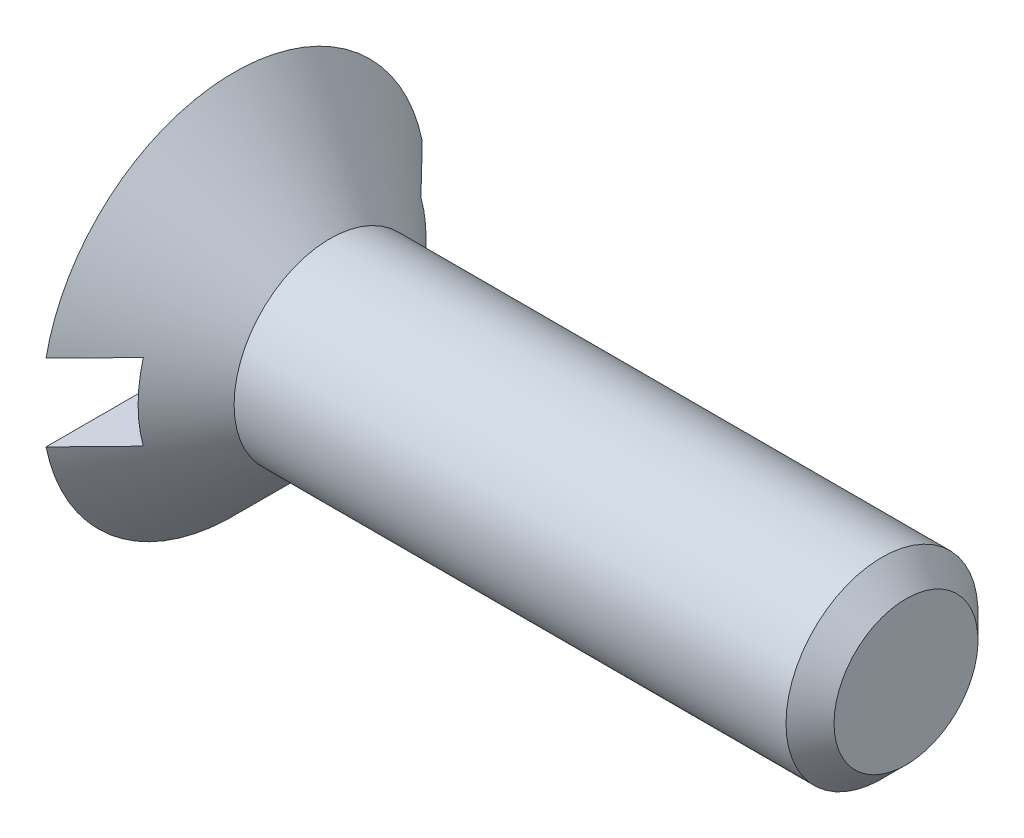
ISO-10303-21;
HEADER;
FILE_DESCRIPTION(('STEP AP214'),'2;1');
FILE_NAME('part.step','',(''),(''),'','','');
FILE_SCHEMA(('AUTOMOTIVE_DESIGN { 1 0 10303 214 1 1 1 1 }'));
ENDSEC;
DATA;
#1=APPLICATION_CONTEXT('core data for automotive mechanical design processes');
#2=APPLICATION_PROTOCOL_DEFINITION('international standard','automotive_design',2000,#1);
#3=PRODUCT_CONTEXT('',#1,'mechanical');
#4=PRODUCT('Part','Part','',(#3));
#5=PRODUCT_RELATED_PRODUCT_CATEGORY('part','',(#4));
#6=PRODUCT_DEFINITION_FORMATION('','',#4);
#7=PRODUCT_DEFINITION_CONTEXT('part definition',#1,'design');
#8=PRODUCT_DEFINITION('design','',#6,#7);
#9=PRODUCT_DEFINITION_SHAPE('','',#8);
#10=(LENGTH_UNIT() NAMED_UNIT(*) SI_UNIT(.MILLI.,.METRE.));
#11=(NAMED_UNIT(*) PLANE_ANGLE_UNIT() SI_UNIT($,.RADIAN.));
#12=(NAMED_UNIT(*) SI_UNIT($,.STERADIAN.) SOLID_ANGLE_UNIT());
#13=UNCERTAINTY_MEASURE_WITH_UNIT(LENGTH_MEASURE(1.E-05),#10,'distance_accuracy_value','');
#14=(GEOMETRIC_REPRESENTATION_CONTEXT(3) GLOBAL_UNCERTAINTY_ASSIGNED_CONTEXT((#13)) GLOBAL_UNIT_ASSIGNED_CONTEXT((#10,
#11,#12)) REPRESENTATION_CONTEXT('',''));
#15=CARTESIAN_POINT('',(0.,0.,0.));
#16=DIRECTION('',(0.,0.,1.));
#17=DIRECTION('',(1.,0.,0.));
#18=AXIS2_PLACEMENT_3D('',#15,#16,#17);
#19=CARTESIAN_POINT('',(0.,0.,0.));
#20=DIRECTION('',(1.,0.,0.));
#21=DIRECTION('',(0.,0.,-1.));
#22=AXIS2_PLACEMENT_3D('',#19,#20,#21);
#23=PLANE('',#22);
#24=CARTESIAN_POINT('',(0.,0.,0.));
#25=DIRECTION('',(-1.,0.,0.));
#26=DIRECTION('',(0.,0.,1.));
#27=AXIS2_PLACEMENT_3D('',#24,#25,#26);
#28=CIRCLE('',#27,2.);
#29=CARTESIAN_POINT('',(0.,0.399999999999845,1.95959179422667));
#30=VERTEX_POINT('',#29);
#31=CARTESIAN_POINT('',(0.,0.399999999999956,-1.95959179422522));
#32=VERTEX_POINT('',#31);
#33=EDGE_CURVE('E121',#30,#32,#28,.T.);
#34=ORIENTED_EDGE('',*,*,#33,.T.);
#35=DIRECTION('',(0.,0.,1.));
#36=VECTOR('',#35,1.);
#37=CARTESIAN_POINT('',(0.,0.399999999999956,-1.99999999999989));
#38=LINE('',#37,#36);
#39=EDGE_CURVE('E113',#32,#30,#38,.T.);
#40=ORIENTED_EDGE('',*,*,#39,.T.);
#41=EDGE_LOOP('',(#34,#40));
#42=FACE_BOUND('',#41,.T.);
#43=ADVANCED_FACE('F22',(#42),#23,.F.);
#44=CARTESIAN_POINT('',(0.,-0.400000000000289,-1.95959179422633));
#45=VERTEX_POINT('',#44);
#46=CARTESIAN_POINT('',(0.,-0.400000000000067,1.95959179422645));
#47=VERTEX_POINT('',#46);
#48=EDGE_CURVE('E86',#45,#47,#28,.T.);
#49=ORIENTED_EDGE('',*,*,#48,.T.);
#50=DIRECTION('',(0.,0.,1.));
#51=VECTOR('',#50,1.);
#52=CARTESIAN_POINT('',(0.,-0.400000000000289,-1.99999999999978));
#53=LINE('',#52,#51);
#54=EDGE_CURVE('E41',#45,#47,#53,.T.);
#55=ORIENTED_EDGE('',*,*,#54,.F.);
#56=EDGE_LOOP('',(#49,#55));
#57=FACE_BOUND('',#56,.T.);
#58=ADVANCED_FACE('F24',(#57),#23,.F.);
#59=CARTESIAN_POINT('',(1.00000000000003,0.,0.));
#60=DIRECTION('',(-1.,0.,0.));
#61=DIRECTION('',(0.,0.,1.));
#62=AXIS2_PLACEMENT_3D('',#59,#60,#61);
#63=CONICAL_SURFACE('',#62,1.,0.785398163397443);
#64=CARTESIAN_POINT('',(0.500000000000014,0.,0.));
#65=DIRECTION('',(1.,0.,0.));
#66=DIRECTION('',(0.,1.,0.));
#67=AXIS2_PLACEMENT_3D('',#64,#65,#66);
#68=CIRCLE('',#67,1.50000000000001);
#69=CARTESIAN_POINT('',(0.500000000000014,-0.400000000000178,-1.44568322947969));
#70=VERTEX_POINT('',#69);
#71=CARTESIAN_POINT('',(0.500000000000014,0.399999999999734,-1.44568322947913));
#72=VERTEX_POINT('',#71);
#73=EDGE_CURVE('E34',#70,#72,#68,.T.);
#74=ORIENTED_EDGE('',*,*,#73,.T.);
#75=CARTESIAN_POINT('',(1.30239394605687,0.399999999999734,-0.571536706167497));
#76=CARTESIAN_POINT('',(1.28076525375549,0.399999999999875,-0.597918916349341));
#77=CARTESIAN_POINT('',(1.25886209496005,0.399999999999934,-0.624072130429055));
#78=CARTESIAN_POINT('',(1.2146314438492,0.399999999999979,-0.676013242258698));
#79=CARTESIAN_POINT('',(1.19230399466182,0.399999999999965,-0.701801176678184));
#80=CARTESIAN_POINT('',(1.12487600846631,0.399999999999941,-0.778751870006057));
#81=CARTESIAN_POINT('',(1.07931952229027,0.399999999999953,-0.829513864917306));
#82=CARTESIAN_POINT('',(0.98750590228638,0.399999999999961,-0.930362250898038));
#83=CARTESIAN_POINT('',(0.941249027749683,0.399999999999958,-0.980448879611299));
#84=CARTESIAN_POINT('',(0.848267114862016,0.399999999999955,-1.08019152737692));
#85=CARTESIAN_POINT('',(0.80154204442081,0.399999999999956,-1.12984751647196));
#86=CARTESIAN_POINT('',(0.711061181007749,0.399999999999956,-1.22539007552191));
#87=CARTESIAN_POINT('',(0.667326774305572,0.399999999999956,-1.27129693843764));
#88=CARTESIAN_POINT('',(0.579658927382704,0.399999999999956,-1.36291788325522));
#89=CARTESIAN_POINT('',(0.535725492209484,0.399999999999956,-1.40863196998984));
#90=CARTESIAN_POINT('',(0.403686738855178,0.399999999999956,-1.54557672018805));
#91=CARTESIAN_POINT('',(0.315359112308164,0.399999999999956,-1.63659291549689));
#92=CARTESIAN_POINT('',(0.106018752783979,0.399999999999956,-1.85147120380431));
#93=CARTESIAN_POINT('',(-0.0151458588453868,0.399999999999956,-1.97518507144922));
#94=CARTESIAN_POINT('',(-0.257845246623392,0.399999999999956,-2.22224902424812));
#95=CARTESIAN_POINT('',(-0.379380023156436,0.399999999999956,-2.34559910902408));
#96=CARTESIAN_POINT('',(-0.622614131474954,0.399999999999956,-2.59200613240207));
#97=CARTESIAN_POINT('',(-0.744313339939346,0.399999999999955,-2.71506319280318));
#98=CARTESIAN_POINT('',(-0.987869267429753,0.399999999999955,-2.9610197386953));
#99=CARTESIAN_POINT('',(-1.10972598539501,0.399999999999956,-3.08391922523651));
#100=CARTESIAN_POINT('',(-1.23162623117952,0.399999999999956,-3.20677534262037));
#101=B_SPLINE_CURVE_WITH_KNOTS('',3,(#75,#76,#77,#78,#79,#80,#81,#82,#83,#84,#85,#86,#87,#88,
#89,#90,#91,#92,#93,#94,#95,#96,#97,#98,#99,#100),.UNSPECIFIED.,.F.,.F.,(4,2,2,2,2,2,2,2,2,2,2,
2,4),(0.,0.102338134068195,0.204665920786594,0.409273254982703,0.613806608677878,
0.81835407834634,1.00856704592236,1.19877521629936,1.57926178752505,2.09875433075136,
2.61824741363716,3.13746169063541,3.65667248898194),.UNSPECIFIED.);
#102=EDGE_CURVE('E11',#72,#32,#101,.T.);
#103=ORIENTED_EDGE('',*,*,#102,.T.);
#104=ORIENTED_EDGE('',*,*,#33,.F.);
#105=CARTESIAN_POINT('',(-0.769434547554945,0.399999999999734,2.7403955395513));
#106=CARTESIAN_POINT('',(-0.664952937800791,0.399999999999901,2.6347932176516));
#107=CARTESIAN_POINT('',(-0.560522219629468,0.399999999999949,2.52914021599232));
#108=CARTESIAN_POINT('',(-0.351848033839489,0.39999999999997,2.3176506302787));
#109=CARTESIAN_POINT('',(-0.247604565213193,0.399999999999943,2.21181404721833));
#110=CARTESIAN_POINT('',(-0.0394108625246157,0.399999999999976,1.99989597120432));
#111=CARTESIAN_POINT('',(0.0645394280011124,0.400000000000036,1.89381453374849));
#112=CARTESIAN_POINT('',(0.272003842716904,0.399999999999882,1.68122605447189));
#113=CARTESIAN_POINT('',(0.375517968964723,0.399999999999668,1.57471901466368));
#114=CARTESIAN_POINT('',(0.538887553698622,0.399999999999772,1.40538776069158));
#115=CARTESIAN_POINT('',(0.599001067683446,0.399999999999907,1.34281281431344));
#116=CARTESIAN_POINT('',(0.718821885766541,0.40000000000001,1.21727970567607));
#117=CARTESIAN_POINT('',(0.778529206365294,0.39999999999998,1.15432155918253));
#118=CARTESIAN_POINT('',(0.897323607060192,0.399999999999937,1.02780129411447));
#119=CARTESIAN_POINT('',(0.956410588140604,0.399999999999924,0.964239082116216));
#120=CARTESIAN_POINT('',(1.04422676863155,0.399999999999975,0.868142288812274));
#121=CARTESIAN_POINT('',(1.0733649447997,0.400000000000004,0.835982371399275));
#122=CARTESIAN_POINT('',(1.13125316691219,0.399999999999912,0.77131228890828));
#123=CARTESIAN_POINT('',(1.16000319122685,0.399999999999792,0.738802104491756));
#124=CARTESIAN_POINT('',(1.18849981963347,0.399999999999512,0.706068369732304));
#125=B_SPLINE_CURVE_WITH_KNOTS('',3,(#105,#106,#107,#108,#109,#110,#111,#112,#113,#114,#115,
#116,#117,#118,#119,#120,#121,#122,#123,#124),.UNSPECIFIED.,.F.,.F.,(4,2,2,2,2,2,2,2,2,4),(0.,
0.44566201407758,0.89132162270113,1.33688856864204,1.78245341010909,2.04276606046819,
2.30306807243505,2.56341101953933,2.69359908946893,2.82379438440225),.UNSPECIFIED.);
#126=CARTESIAN_POINT('',(0.5,0.399999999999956,1.44568322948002));
#127=VERTEX_POINT('',#126);
#128=EDGE_CURVE('E49',#30,#127,#125,.T.);
#129=ORIENTED_EDGE('',*,*,#128,.T.);
#130=CARTESIAN_POINT('',(0.5,-0.399999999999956,1.44568322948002));
#131=VERTEX_POINT('',#130);
#132=EDGE_CURVE('E78',#127,#131,#68,.T.);
#133=ORIENTED_EDGE('',*,*,#132,.T.);
#134=CARTESIAN_POINT('',(1.18849981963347,-0.400000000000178,0.706068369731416));
#135=CARTESIAN_POINT('',(1.16000319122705,-0.400000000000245,0.73880210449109));
#136=CARTESIAN_POINT('',(1.13125316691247,-0.400000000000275,0.771312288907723));
#137=CARTESIAN_POINT('',(1.07336494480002,-0.400000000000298,0.835982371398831));
#138=CARTESIAN_POINT('',(1.04422676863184,-0.400000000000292,0.868142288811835));
#139=CARTESIAN_POINT('',(0.956410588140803,-0.400000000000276,0.964239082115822));
#140=CARTESIAN_POINT('',(0.897323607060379,-0.400000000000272,1.02780129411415));
#141=CARTESIAN_POINT('',(0.778529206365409,-0.400000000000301,1.15432155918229));
#142=CARTESIAN_POINT('',(0.718821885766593,-0.400000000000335,1.21727970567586));
#143=CARTESIAN_POINT('',(0.599001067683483,-0.400000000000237,1.34281281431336));
#144=CARTESIAN_POINT('',(0.538887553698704,-0.400000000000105,1.40538776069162));
#145=CARTESIAN_POINT('',(0.375517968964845,-0.400000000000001,1.57471901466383));
#146=CARTESIAN_POINT('',(0.272003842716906,-0.40000000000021,1.68122605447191));
#147=CARTESIAN_POINT('',(0.0645394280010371,-0.400000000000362,1.8938145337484));
#148=CARTESIAN_POINT('',(-0.0394108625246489,-0.400000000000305,1.99989597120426));
#149=CARTESIAN_POINT('',(-0.247604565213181,-0.400000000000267,2.21181404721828));
#150=CARTESIAN_POINT('',(-0.351848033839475,-0.400000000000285,2.31765063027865));
#151=CARTESIAN_POINT('',(-0.56052221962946,-0.400000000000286,2.52914021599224));
#152=CARTESIAN_POINT('',(-0.664952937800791,-0.400000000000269,2.6347932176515));
#153=CARTESIAN_POINT('',(-0.769434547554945,-0.400000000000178,2.74039553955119));
#154=B_SPLINE_CURVE_WITH_KNOTS('',3,(#134,#135,#136,#137,#138,#139,#140,#141,#142,#143,#144,
#145,#146,#147,#148,#149,#150,#151,#152,#153),.UNSPECIFIED.,.F.,.F.,(4,2,2,2,2,2,2,2,2,4),(0.,
0.130195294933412,0.260383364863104,0.520726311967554,0.781028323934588,1.04134097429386,
1.48690581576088,1.93247276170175,2.37813237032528,2.82379438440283),.UNSPECIFIED.);
#155=EDGE_CURVE('E80',#131,#47,#154,.T.);
#156=ORIENTED_EDGE('',*,*,#155,.T.);
#157=ORIENTED_EDGE('',*,*,#48,.F.);
#158=CARTESIAN_POINT('',(-1.23162623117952,-0.400000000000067,-3.2067753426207));
#159=CARTESIAN_POINT('',(-1.10967520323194,-0.40000000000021,-3.08386807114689));
#160=CARTESIAN_POINT('',(-0.987767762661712,-0.400000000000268,-2.96091737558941));
#161=CARTESIAN_POINT('',(-0.744116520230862,-0.400000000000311,-2.71486428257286));
#162=CARTESIAN_POINT('',(-0.622372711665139,-0.400000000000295,-2.59176189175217));
#163=CARTESIAN_POINT('',(-0.379144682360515,-0.400000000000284,-2.34536037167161));
#164=CARTESIAN_POINT('',(-0.25766040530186,-0.400000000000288,-2.22206129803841));
#165=CARTESIAN_POINT('',(-0.0150565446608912,-0.400000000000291,-1.97509370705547));
#166=CARTESIAN_POINT('',(0.10606302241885,-0.40000000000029,-1.851425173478));
#167=CARTESIAN_POINT('',(0.318673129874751,-0.400000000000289,-1.63319167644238));
#168=CARTESIAN_POINT('',(0.410301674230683,-0.400000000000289,-1.53876142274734));
#169=CARTESIAN_POINT('',(0.547251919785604,-0.400000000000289,-1.39665099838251));
#170=CARTESIAN_POINT('',(0.592817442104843,-0.400000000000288,-1.34920594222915));
#171=CARTESIAN_POINT('',(0.683726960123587,-0.400000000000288,-1.25410164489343));
#172=CARTESIAN_POINT('',(0.729070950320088,-0.400000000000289,-1.20644239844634));
#173=CARTESIAN_POINT('',(0.819465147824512,-0.400000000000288,-1.11081357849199));
#174=CARTESIAN_POINT('',(0.864515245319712,-0.400000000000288,-1.06284390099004));
#175=CARTESIAN_POINT('',(0.954159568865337,-0.400000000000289,-0.966485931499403));
#176=CARTESIAN_POINT('',(0.998753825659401,-0.40000000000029,-0.918097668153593));
#177=CARTESIAN_POINT('',(1.08726655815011,-0.400000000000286,-0.820671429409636));
#178=CARTESIAN_POINT('',(1.13118478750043,-0.40000000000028,-0.771633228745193));
#179=CARTESIAN_POINT('',(1.19619901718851,-0.400000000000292,-0.697308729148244));
#180=CARTESIAN_POINT('',(1.21772899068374,-0.400000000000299,-0.672403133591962));
#181=CARTESIAN_POINT('',(1.26038955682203,-0.400000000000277,-0.62224861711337));
#182=CARTESIAN_POINT('',(1.28152011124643,-0.400000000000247,-0.596999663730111));
#183=CARTESIAN_POINT('',(1.30239394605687,-0.400000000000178,-0.571536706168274));
#184=B_SPLINE_CURVE_WITH_KNOTS('',3,(#158,#159,#160,#161,#162,#163,#164,#165,#166,#167,#168,
#169,#170,#171,#172,#173,#174,#175,#176,#177,#178,#179,#180,#181,#182,#183),.UNSPECIFIED.,.F.,
.F.,(4,2,2,2,2,2,2,2,2,2,2,2,4),(0.,0.519427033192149,1.03883209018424,1.55810981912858,
2.07741070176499,2.47214361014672,2.66948860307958,2.86683847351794,3.0642582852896,
3.26166469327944,3.45914141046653,3.55790239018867,3.65667277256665),.UNSPECIFIED.);
#185=EDGE_CURVE('E76',#45,#70,#184,.T.);
#186=ORIENTED_EDGE('',*,*,#185,.T.);
#187=EDGE_LOOP('',(#74,#103,#104,#129,#133,#156,#157,#186));
#188=FACE_BOUND('',#187,.T.);
#189=CARTESIAN_POINT('',(1.00000000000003,0.,0.));
#190=DIRECTION('',(-1.,0.,0.));
#191=DIRECTION('',(0.,0.,1.));
#192=AXIS2_PLACEMENT_3D('',#189,#190,#191);
#193=CIRCLE('',#192,1.);
#194=CARTESIAN_POINT('',(1.00000000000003,0.,1.));
#195=VERTEX_POINT('',#194);
#196=EDGE_CURVE('E115',#195,#195,#193,.T.);
#197=ORIENTED_EDGE('',*,*,#196,.T.);
#198=EDGE_LOOP('',(#197));
#199=FACE_BOUND('',#198,.T.);
#200=ADVANCED_FACE('F83',(#188,#199),#63,.T.);
#201=CARTESIAN_POINT('',(0.,0.,0.));
#202=DIRECTION('',(-1.,0.,0.));
#203=DIRECTION('',(0.,0.,1.));
#204=AXIS2_PLACEMENT_3D('',#201,#202,#203);
#205=CYLINDRICAL_SURFACE('',#204,1.);
#206=CARTESIAN_POINT('',(6.75000000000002,0.,0.));
#207=DIRECTION('',(-1.,0.,0.));
#208=DIRECTION('',(0.,0.,1.));
#209=AXIS2_PLACEMENT_3D('',#206,#207,#208);
#210=CIRCLE('',#209,1.);
#211=CARTESIAN_POINT('',(6.75000000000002,0.,1.));
#212=VERTEX_POINT('',#211);
#213=EDGE_CURVE('E122',#212,#212,#210,.T.);
#214=ORIENTED_EDGE('',*,*,#213,.T.);
#215=EDGE_LOOP('',(#214));
#216=FACE_BOUND('',#215,.T.);
#217=ORIENTED_EDGE('',*,*,#196,.F.);
#218=EDGE_LOOP('',(#217));
#219=FACE_BOUND('',#218,.T.);
#220=ADVANCED_FACE('F139',(#216,#219),#205,.T.);
#221=CARTESIAN_POINT('',(7.00000000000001,0.999999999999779,3.33066907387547E-13));
#222=DIRECTION('',(-1.,0.,0.));
#223=DIRECTION('',(0.,0.,1.));
#224=AXIS2_PLACEMENT_3D('',#221,#222,#223);
#225=PLANE('',#224);
#226=CARTESIAN_POINT('',(7.00000000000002,0.,0.));
#227=DIRECTION('',(-1.,0.,0.));
#228=DIRECTION('',(0.,0.,1.));
#229=AXIS2_PLACEMENT_3D('',#226,#227,#228);
#230=CIRCLE('',#229,0.749999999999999);
#231=CARTESIAN_POINT('',(7.00000000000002,0.,0.75));
#232=VERTEX_POINT('',#231);
#233=EDGE_CURVE('E109',#232,#232,#230,.F.);
#234=ORIENTED_EDGE('',*,*,#233,.T.);
#235=EDGE_LOOP('',(#234));
#236=FACE_BOUND('',#235,.T.);
#237=ADVANCED_FACE('F143',(#236),#225,.F.);
#238=CARTESIAN_POINT('',(6.75000000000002,0.,0.));
#239=DIRECTION('',(-1.,0.,0.));
#240=DIRECTION('',(0.,0.,1.));
#241=AXIS2_PLACEMENT_3D('',#238,#239,#240);
#242=CONICAL_SURFACE('',#241,1.,0.78539816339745);
#243=ORIENTED_EDGE('',*,*,#233,.F.);
#244=EDGE_LOOP('',(#243));
#245=FACE_BOUND('',#244,.T.);
#246=ORIENTED_EDGE('',*,*,#213,.F.);
#247=EDGE_LOOP('',(#246));
#248=FACE_BOUND('',#247,.T.);
#249=ADVANCED_FACE('F101',(#245,#248),#242,.T.);
#250=CARTESIAN_POINT('',(0.,0.399999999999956,-1.99999999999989));
#251=DIRECTION('',(0.,1.,0.));
#252=DIRECTION('',(0.,0.,1.));
#253=AXIS2_PLACEMENT_3D('',#250,#251,#252);
#254=PLANE('',#253);
#255=DIRECTION('',(0.,0.,1.));
#256=VECTOR('',#255,1.);
#257=CARTESIAN_POINT('',(0.500000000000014,0.399999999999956,-1.99999999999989));
#258=LINE('',#257,#256);
#259=EDGE_CURVE('E73',#72,#127,#258,.T.);
#260=ORIENTED_EDGE('',*,*,#259,.T.);
#261=ORIENTED_EDGE('',*,*,#128,.F.);
#262=ORIENTED_EDGE('',*,*,#39,.F.);
#263=ORIENTED_EDGE('',*,*,#102,.F.);
#264=EDGE_LOOP('',(#260,#261,#262,#263));
#265=FACE_BOUND('',#264,.T.);
#266=ADVANCED_FACE('F112',(#265),#254,.F.);
#267=CARTESIAN_POINT('',(0.500000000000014,0.399999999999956,-1.99999999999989));
#268=DIRECTION('',(1.,0.,0.));
#269=DIRECTION('',(0.,1.,0.));
#270=AXIS2_PLACEMENT_3D('',#267,#268,#269);
#271=PLANE('',#270);
#272=ORIENTED_EDGE('',*,*,#259,.F.);
#273=ORIENTED_EDGE('',*,*,#73,.F.);
#274=DIRECTION('',(0.,0.,1.));
#275=VECTOR('',#274,1.);
#276=CARTESIAN_POINT('',(0.500000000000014,-0.400000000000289,-1.99999999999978));
#277=LINE('',#276,#275);
#278=EDGE_CURVE('E71',#70,#131,#277,.T.);
#279=ORIENTED_EDGE('',*,*,#278,.T.);
#280=ORIENTED_EDGE('',*,*,#132,.F.);
#281=EDGE_LOOP('',(#272,#273,#279,#280));
#282=FACE_BOUND('',#281,.T.);
#283=ADVANCED_FACE('F70',(#282),#271,.F.);
#284=CARTESIAN_POINT('',(0.500000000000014,-0.400000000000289,-1.99999999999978));
#285=DIRECTION('',(0.,-1.,0.));
#286=DIRECTION('',(1.,0.,0.));
#287=AXIS2_PLACEMENT_3D('',#284,#285,#286);
#288=PLANE('',#287);
#289=ORIENTED_EDGE('',*,*,#54,.T.);
#290=ORIENTED_EDGE('',*,*,#155,.F.);
#291=ORIENTED_EDGE('',*,*,#278,.F.);
#292=ORIENTED_EDGE('',*,*,#185,.F.);
#293=EDGE_LOOP('',(#289,#290,#291,#292));
#294=FACE_BOUND('',#293,.T.);
#295=ADVANCED_FACE('F79',(#294),#288,.F.);
#296=CLOSED_SHELL('',(#43,#58,#200,#220,#237,#249,#266,#283,#295));
#297=MANIFOLD_SOLID_BREP('B2',#296);
#298=ADVANCED_BREP_SHAPE_REPRESENTATION('',(#18,#297),#14);
#299=SHAPE_DEFINITION_REPRESENTATION(#9,#298);
ENDSEC;
END-ISO-10303-21;
